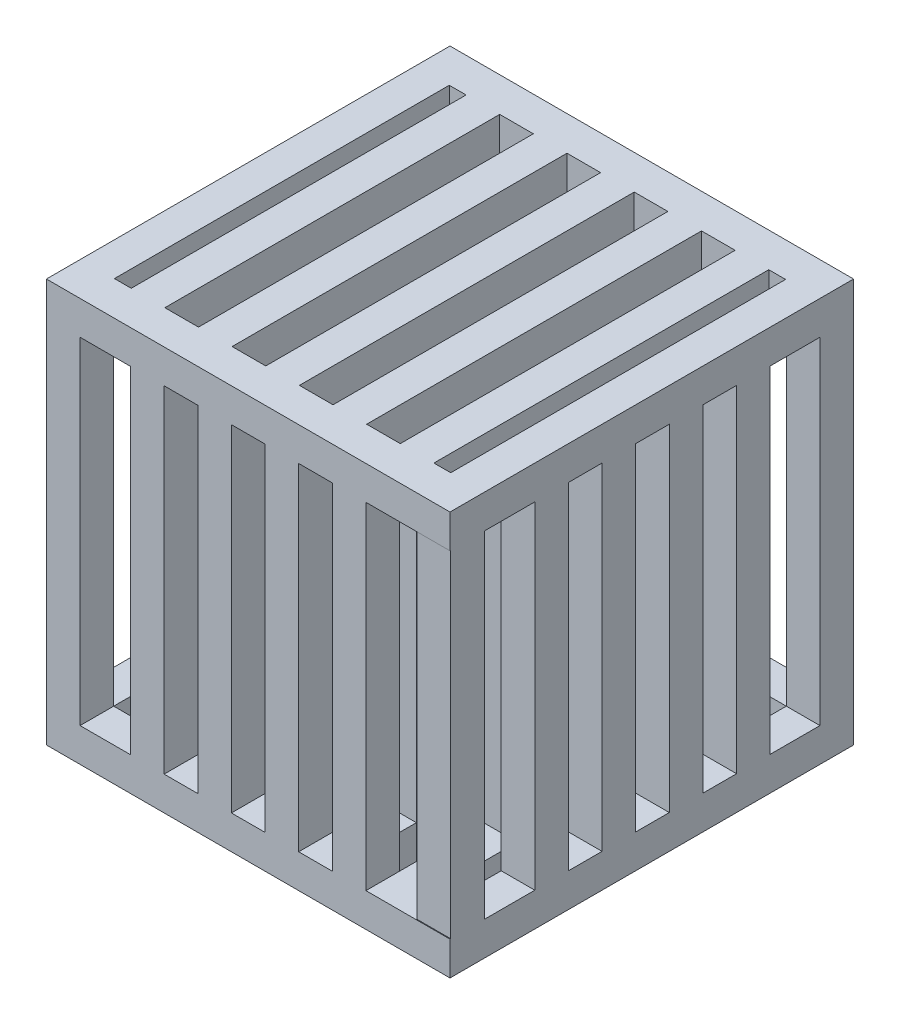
from build123d import *

# Parameters (mm, degrees)
SKETCH1_W            = 60
SKETCH1_H            = 60
SKETCH1_W_2          = 50
SKETCH1_H_2          = 50
BOSS_EXTRUDE1_DEPTH  = 5
SKETCH2_W            = 5
SKETCH2_H            = 5
BOSS_EXTRUDE2_DEPTH  = 50
LPATTERN2_COUNT      = 5
LPATTERN2_PITCH      = 10
SKETCH3_W            = 5
SKETCH3_H            = 5
BOSS_EXTRUDE3_DEPTH  = 50
LPATTERN4_COUNT      = 5
LPATTERN4_PITCH      = 10
SKETCH4_W            = 5
SKETCH4_H            = 5
BOSS_EXTRUDE4_DEPTH  = 50
LPATTERN5_COUNT      = 4
LPATTERN5_PITCH      = 10
SKETCH5_W            = 5
SKETCH5_H            = 5
BOSS_EXTRUDE5_DEPTH  = 50
LPATTERN6_COUNT      = 5
LPATTERN6_PITCH      = 10
SKETCH7_W            = 5
SKETCH7_H            = 4.992399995
BOSS_EXTRUDE6_DEPTH  = 50
LPATTERN7_COUNT      = 4
LPATTERN7_PITCH      = 10
SKETCH6_W            = 5
SKETCH6_H            = 4.837191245
BOSS_EXTRUDE7_DEPTH  = 50
LPATTERN8_COUNT      = 5
LPATTERN8_PITCH      = 10
SKETCH9_W            = 5
SKETCH9_H            = 5
BOSS_EXTRUDE8_DEPTH  = 50
SKETCH10_W           = 60
SKETCH10_H           = 60
SKETCH10_W_2         = 50
SKETCH10_H_2         = 49.784438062
BOSS_EXTRUDE9_DEPTH  = 5
SKETCH11_W           = 5
SKETCH11_H           = 5
BOSS_EXTRUDE11_DEPTH = 50
LPATTERN9_COUNT      = 5
LPATTERN9_PITCH      = 10
SKETCH12_W           = 5
SKETCH12_H           = 5
BOSS_EXTRUDE12_DEPTH = 50
LPATTERN10_COUNT     = 4
LPATTERN10_PITCH     = 10
SKETCH13_W           = 5
SKETCH13_H           = 5
BOSS_EXTRUDE13_DEPTH = 50
LPATTERN11_COUNT     = 4
LPATTERN11_PITCH     = 10
SKETCH14_W           = 5
SKETCH14_H           = 4.82404103
BOSS_EXTRUDE14_DEPTH = 50
LPATTERN12_COUNT     = 4
LPATTERN12_PITCH     = 10
SKETCH15_W           = 5
SKETCH15_H           = 5
BOSS_EXTRUDE15_DEPTH = 50
LPATTERN13_COUNT     = 4
LPATTERN13_PITCH     = 10


with BuildPart() as part:
    # Sketch1 → Boss-Extrude1 (new body)
    with BuildSketch(Plane(origin=(0, 0, 0), x_dir=(1, 0, 0), z_dir=(0, 1, 0))):
        Rectangle(SKETCH1_W, SKETCH1_H)
        Rectangle(SKETCH1_W_2, SKETCH1_H_2, mode=Mode.SUBTRACT)
    extrude(amount=BOSS_EXTRUDE1_DEPTH)

    # Sketch2 → Boss-Extrude2 (add)
    with BuildSketch(Plane(origin=(0, 0, 25), x_dir=(-1, 0, 0), z_dir=(0, 0, -1))):
        with Locations((20, 2.5)):
            Rectangle(SKETCH2_W, SKETCH2_H)
    boss_extrude2 = extrude(amount=BOSS_EXTRUDE2_DEPTH)

    # LPattern2: Boss-Extrude2 ×5
    with Locations(*[(i * LPATTERN2_PITCH, 0, 0) for i in range(1, LPATTERN2_COUNT)]):
        add(boss_extrude2)

    # Sketch3 → Boss-Extrude3 (add)
    with BuildSketch(Plane(origin=(0, 5, 0), x_dir=(1, 0, 0), z_dir=(0, 1, 0))):
        with Locations((-20, -20)):
            Rectangle(SKETCH3_W, SKETCH3_H)
    boss_extrude3 = extrude(amount=BOSS_EXTRUDE3_DEPTH)

    # LPattern4: Boss-Extrude3 ×5
    with Locations(*[(0, 0, -i * LPATTERN4_PITCH) for i in range(1, LPATTERN4_COUNT)]):
        add(boss_extrude3)

    # Sketch4 → Boss-Extrude4 (add)
    with BuildSketch(Plane(origin=(0, 5, 0), x_dir=(1, 0, 0), z_dir=(0, 1, 0))):
        with Locations((-10, -15)):
            Rectangle(SKETCH4_W, SKETCH4_H)
    boss_extrude4 = extrude(amount=BOSS_EXTRUDE4_DEPTH)

    # LPattern5: Boss-Extrude4 ×4
    with Locations(*[(0, 0, -i * LPATTERN5_PITCH) for i in range(1, LPATTERN5_COUNT)]):
        add(boss_extrude4)

    # Sketch5 → Boss-Extrude5 (add)
    with BuildSketch(Plane(origin=(0, 5, 0), x_dir=(1, 0, 0), z_dir=(0, 1, 0))):
        with Locations((0, -20)):
            Rectangle(SKETCH5_W, SKETCH5_H)
    boss_extrude5 = extrude(amount=BOSS_EXTRUDE5_DEPTH)

    # LPattern6: Boss-Extrude5 ×5
    with Locations(*[(0, 0, -i * LPATTERN6_PITCH) for i in range(1, LPATTERN6_COUNT)]):
        add(boss_extrude5)

    # Sketch7 → Boss-Extrude6 (add)
    with BuildSketch(Plane(origin=(0, 5, 0), x_dir=(1, 0, 0), z_dir=(0, 1, 0))):
        with Locations((10, -15.003800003)):
            Rectangle(SKETCH7_W, SKETCH7_H)
    boss_extrude6 = extrude(amount=BOSS_EXTRUDE6_DEPTH)

    # LPattern7: Boss-Extrude6 ×4
    with Locations(*[(0, 0, -i * LPATTERN7_PITCH) for i in range(1, LPATTERN7_COUNT)]):
        add(boss_extrude6)

    # Sketch6 → Boss-Extrude7 (add)
    with BuildSketch(Plane(origin=(0, 5, 0), x_dir=(1, 0, 0), z_dir=(0, 1, 0))):
        with Locations((20, -20.081404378)):
            Rectangle(SKETCH6_W, SKETCH6_H)
    boss_extrude7 = extrude(amount=BOSS_EXTRUDE7_DEPTH)

    # LPattern8: Boss-Extrude7 ×5
    with Locations(*[(0, 0, -i * LPATTERN8_PITCH) for i in range(1, LPATTERN8_COUNT)]):
        add(boss_extrude7)

    # Sketch9 → Boss-Extrude8 (add)
    with BuildSketch(Plane(origin=(0, 5, 0), x_dir=(1, 0, 0), z_dir=(0, 1, 0))):
        with Locations((27.5, -27.392219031)):
            Rectangle(SKETCH9_W, SKETCH9_H)
        with Locations((-27.5, -27.5)):
            Rectangle(SKETCH9_W, SKETCH9_H)
        with Locations((27.5, 27.5)):
            Rectangle(SKETCH9_W, SKETCH9_H)
        with Locations((-27.5, 27.5)):
            Rectangle(SKETCH9_W, SKETCH9_H)
    extrude(amount=BOSS_EXTRUDE8_DEPTH)

    # Sketch10 → Boss-Extrude9 (add)
    with BuildSketch(Plane(origin=(0, 55, 0), x_dir=(1, 0, 0), z_dir=(0, 1, 0))):
        Rectangle(SKETCH10_W, SKETCH10_H)
        Rectangle(SKETCH10_W_2, SKETCH10_H_2, mode=Mode.SUBTRACT)
    extrude(amount=BOSS_EXTRUDE9_DEPTH)

    # Sketch12 → Boss-Extrude12 (add)
    with BuildSketch(Plane(origin=(0, 5, 0), x_dir=(1, 0, 0), z_dir=(0, 1, 0))):
        with Locations((27.5, -14.892219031)):
            Rectangle(SKETCH12_W, SKETCH12_H)
    boss_extrude12 = extrude(amount=BOSS_EXTRUDE12_DEPTH)

    # LPattern10: Boss-Extrude12 ×4
    with Locations(*[(0, 0, -i * LPATTERN10_PITCH) for i in range(1, LPATTERN10_COUNT)]):
        add(boss_extrude12)

    # Sketch13 → Boss-Extrude13 (add)
    with BuildSketch(Plane(origin=(0, 5, 0), x_dir=(1, 0, 0), z_dir=(0, 1, 0))):
        with Locations((15, 27.5)):
            Rectangle(SKETCH13_W, SKETCH13_H)
    boss_extrude13 = extrude(amount=BOSS_EXTRUDE13_DEPTH)

    # LPattern11: Boss-Extrude13 ×4
    with Locations(*[(-i * LPATTERN11_PITCH, 0, 0) for i in range(1, LPATTERN11_COUNT)]):
        add(boss_extrude13)

    # Sketch14 → Boss-Extrude14 (add)
    with BuildSketch(Plane(origin=(0, 5, 0), x_dir=(1, 0, 0), z_dir=(0, 1, 0))):
        with Locations((-27.5, 15.087979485)):
            Rectangle(SKETCH14_W, SKETCH14_H)
    boss_extrude14 = extrude(amount=BOSS_EXTRUDE14_DEPTH)

    # LPattern12: Boss-Extrude14 ×4
    with Locations(*[(0, 0, i * LPATTERN12_PITCH) for i in range(1, LPATTERN12_COUNT)]):
        add(boss_extrude14)



with BuildPart() as body_2:
    # Sketch11 → Boss-Extrude11 (new body)
    with BuildSketch(Plane.XY.offset(-24.892219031)):
        with Locations((20, 57.5)):
            Rectangle(SKETCH11_W, SKETCH11_H)
    boss_extrude11 = extrude(amount=BOSS_EXTRUDE11_DEPTH)


with BuildPart() as lpattern9_1:
    # LPattern9: pattern copy
    add(boss_extrude11.moved(Location(Vector(-1, 0, 0) * (1 * LPATTERN9_PITCH))))


with BuildPart() as lpattern9_2:
    # LPattern9: pattern copy
    add(boss_extrude11.moved(Location(Vector(-1, 0, 0) * (2 * LPATTERN9_PITCH))))


with BuildPart() as lpattern9_3:
    # LPattern9: pattern copy
    add(boss_extrude11.moved(Location(Vector(-1, 0, 0) * (3 * LPATTERN9_PITCH))))


with BuildPart() as lpattern9_4:
    # LPattern9: pattern copy
    add(boss_extrude11.moved(Location(Vector(-1, 0, 0) * (4 * LPATTERN9_PITCH))))


with BuildPart() as part_1:
    add(part.part)

    add(lpattern9_3.part)  # Boss-Extrude15 merges LPattern9_3

    add(lpattern9_4.part)  # Boss-Extrude15 merges LPattern9_4
    # Sketch15 → Boss-Extrude15 (add)
    with BuildSketch(Plane(origin=(0, 5, 0), x_dir=(1, 0, 0), z_dir=(0, 1, 0))):
        with Locations((-15, -27.5)):
            Rectangle(SKETCH15_W, SKETCH15_H)
    boss_extrude15 = extrude(amount=BOSS_EXTRUDE15_DEPTH)


    add(body_2.part)  # LPattern13 merges body 2

    add(lpattern9_1.part)  # LPattern13 merges LPattern9_1

    add(lpattern9_2.part)  # LPattern13 merges LPattern9_2
    # LPattern13: Boss-Extrude15 ×4
    with Locations(*[(i * LPATTERN13_PITCH, 0, 0) for i in range(1, LPATTERN13_COUNT)]):
        add(boss_extrude15)


solid = part_1.part
